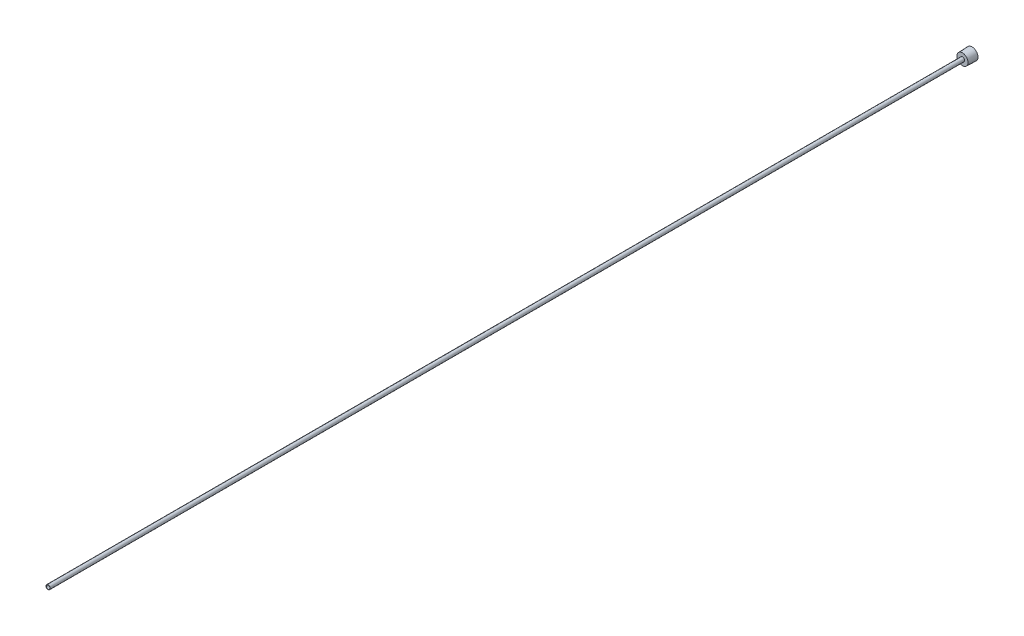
ISO-10303-21;
HEADER;
FILE_DESCRIPTION(('STEP AP214'),'2;1');
FILE_NAME('part.step','',(''),(''),'','','');
FILE_SCHEMA(('AUTOMOTIVE_DESIGN { 1 0 10303 214 1 1 1 1 }'));
ENDSEC;
DATA;
#1=APPLICATION_CONTEXT('core data for automotive mechanical design processes');
#2=APPLICATION_PROTOCOL_DEFINITION('international standard','automotive_design',2000,#1);
#3=PRODUCT_CONTEXT('',#1,'mechanical');
#4=PRODUCT('Part','Part','',(#3));
#5=PRODUCT_RELATED_PRODUCT_CATEGORY('part','',(#4));
#6=PRODUCT_DEFINITION_FORMATION('','',#4);
#7=PRODUCT_DEFINITION_CONTEXT('part definition',#1,'design');
#8=PRODUCT_DEFINITION('design','',#6,#7);
#9=PRODUCT_DEFINITION_SHAPE('','',#8);
#10=(LENGTH_UNIT() NAMED_UNIT(*) SI_UNIT(.MILLI.,.METRE.));
#11=(NAMED_UNIT(*) PLANE_ANGLE_UNIT() SI_UNIT($,.RADIAN.));
#12=(NAMED_UNIT(*) SI_UNIT($,.STERADIAN.) SOLID_ANGLE_UNIT());
#13=UNCERTAINTY_MEASURE_WITH_UNIT(LENGTH_MEASURE(1.E-05),#10,'distance_accuracy_value','');
#14=(GEOMETRIC_REPRESENTATION_CONTEXT(3) GLOBAL_UNCERTAINTY_ASSIGNED_CONTEXT((#13)) GLOBAL_UNIT_ASSIGNED_CONTEXT((#10,
#11,#12)) REPRESENTATION_CONTEXT('',''));
#15=CARTESIAN_POINT('',(0.,0.,0.));
#16=DIRECTION('',(0.,0.,1.));
#17=DIRECTION('',(1.,0.,0.));
#18=AXIS2_PLACEMENT_3D('',#15,#16,#17);
#19=CARTESIAN_POINT('',(0.,0.,0.));
#20=DIRECTION('',(0.,0.,1.));
#21=DIRECTION('',(1.,0.,0.));
#22=AXIS2_PLACEMENT_3D('',#19,#20,#21);
#23=CYLINDRICAL_SURFACE('',#22,1.2065);
#24=CARTESIAN_POINT('',(0.,0.,609.6));
#25=DIRECTION('',(0.,0.,1.));
#26=DIRECTION('',(1.,0.,0.));
#27=AXIS2_PLACEMENT_3D('',#24,#25,#26);
#28=CIRCLE('',#27,1.2065);
#29=CARTESIAN_POINT('',(1.2065,0.,609.6));
#30=VERTEX_POINT('',#29);
#31=EDGE_CURVE('E142',#30,#30,#28,.T.);
#32=CARTESIAN_POINT('',(0.,0.,3.96875));
#33=DIRECTION('',(0.,0.,-1.));
#34=DIRECTION('',(-1.,0.,0.));
#35=AXIS2_PLACEMENT_3D('',#32,#33,#34);
#36=CIRCLE('',#35,1.2065);
#37=CARTESIAN_POINT('',(1.2065,0.,3.96875));
#38=VERTEX_POINT('',#37);
#39=EDGE_CURVE('E37',#38,#38,#36,.F.);
#40=CARTESIAN_POINT('',(1.2065,0.,609.6));
#41=CARTESIAN_POINT('',(1.2065,0.,603.291341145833));
#42=CARTESIAN_POINT('',(1.2065,0.,596.982682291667));
#43=CARTESIAN_POINT('',(1.2065,0.,584.365364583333));
#44=CARTESIAN_POINT('',(1.2065,0.,578.056705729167));
#45=CARTESIAN_POINT('',(1.2065,0.,565.439388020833));
#46=CARTESIAN_POINT('',(1.2065,0.,559.130729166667));
#47=CARTESIAN_POINT('',(1.2065,0.,546.513411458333));
#48=CARTESIAN_POINT('',(1.2065,0.,540.204752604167));
#49=CARTESIAN_POINT('',(1.2065,0.,527.587434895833));
#50=CARTESIAN_POINT('',(1.2065,0.,521.278776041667));
#51=CARTESIAN_POINT('',(1.2065,0.,508.661458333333));
#52=CARTESIAN_POINT('',(1.2065,0.,502.352799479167));
#53=CARTESIAN_POINT('',(1.2065,0.,489.735481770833));
#54=CARTESIAN_POINT('',(1.2065,0.,483.426822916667));
#55=CARTESIAN_POINT('',(1.2065,0.,470.809505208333));
#56=CARTESIAN_POINT('',(1.2065,0.,464.500846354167));
#57=CARTESIAN_POINT('',(1.2065,0.,451.883528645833));
#58=CARTESIAN_POINT('',(1.2065,0.,445.574869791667));
#59=CARTESIAN_POINT('',(1.2065,0.,432.957552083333));
#60=CARTESIAN_POINT('',(1.2065,0.,426.648893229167));
#61=CARTESIAN_POINT('',(1.2065,0.,414.031575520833));
#62=CARTESIAN_POINT('',(1.2065,0.,407.722916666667));
#63=CARTESIAN_POINT('',(1.2065,0.,395.105598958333));
#64=CARTESIAN_POINT('',(1.2065,0.,388.796940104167));
#65=CARTESIAN_POINT('',(1.2065,0.,376.179622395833));
#66=CARTESIAN_POINT('',(1.2065,0.,369.870963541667));
#67=CARTESIAN_POINT('',(1.2065,0.,357.253645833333));
#68=CARTESIAN_POINT('',(1.2065,0.,350.944986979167));
#69=CARTESIAN_POINT('',(1.2065,0.,338.327669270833));
#70=CARTESIAN_POINT('',(1.2065,0.,332.019010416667));
#71=CARTESIAN_POINT('',(1.2065,0.,319.401692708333));
#72=CARTESIAN_POINT('',(1.2065,0.,313.093033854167));
#73=CARTESIAN_POINT('',(1.2065,0.,300.475716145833));
#74=CARTESIAN_POINT('',(1.2065,0.,294.167057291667));
#75=CARTESIAN_POINT('',(1.2065,0.,281.549739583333));
#76=CARTESIAN_POINT('',(1.2065,0.,275.241080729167));
#77=CARTESIAN_POINT('',(1.2065,0.,262.623763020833));
#78=CARTESIAN_POINT('',(1.2065,0.,256.315104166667));
#79=CARTESIAN_POINT('',(1.2065,0.,243.697786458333));
#80=CARTESIAN_POINT('',(1.2065,0.,237.389127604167));
#81=CARTESIAN_POINT('',(1.2065,0.,224.771809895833));
#82=CARTESIAN_POINT('',(1.2065,0.,218.463151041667));
#83=CARTESIAN_POINT('',(1.2065,0.,205.845833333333));
#84=CARTESIAN_POINT('',(1.2065,0.,199.537174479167));
#85=CARTESIAN_POINT('',(1.2065,0.,186.919856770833));
#86=CARTESIAN_POINT('',(1.2065,0.,180.611197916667));
#87=CARTESIAN_POINT('',(1.2065,0.,167.993880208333));
#88=CARTESIAN_POINT('',(1.2065,0.,161.685221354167));
#89=CARTESIAN_POINT('',(1.2065,0.,149.067903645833));
#90=CARTESIAN_POINT('',(1.2065,0.,142.759244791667));
#91=CARTESIAN_POINT('',(1.2065,0.,130.141927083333));
#92=CARTESIAN_POINT('',(1.2065,0.,123.833268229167));
#93=CARTESIAN_POINT('',(1.2065,0.,111.215950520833));
#94=CARTESIAN_POINT('',(1.2065,0.,104.907291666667));
#95=CARTESIAN_POINT('',(1.2065,0.,92.2899739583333));
#96=CARTESIAN_POINT('',(1.2065,0.,85.9813151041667));
#97=CARTESIAN_POINT('',(1.2065,0.,73.3639973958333));
#98=CARTESIAN_POINT('',(1.2065,0.,67.0553385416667));
#99=CARTESIAN_POINT('',(1.2065,0.,54.4380208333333));
#100=CARTESIAN_POINT('',(1.2065,0.,48.1293619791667));
#101=CARTESIAN_POINT('',(1.2065,0.,35.5120442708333));
#102=CARTESIAN_POINT('',(1.2065,0.,29.2033854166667));
#103=CARTESIAN_POINT('',(1.2065,0.,16.5860677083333));
#104=CARTESIAN_POINT('',(1.2065,0.,10.2774088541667));
#105=CARTESIAN_POINT('',(1.2065,0.,3.96874999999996));
#106=B_SPLINE_CURVE_WITH_KNOTS('',3,(#40,#41,#42,#43,#44,#45,#46,#47,#48,#49,#50,#51,#52,#53,
#54,#55,#56,#57,#58,#59,#60,#61,#62,#63,#64,#65,#66,#67,#68,#69,#70,#71,#72,#73,#74,#75,#76,#77,
#78,#79,#80,#81,#82,#83,#84,#85,#86,#87,#88,#89,#90,#91,#92,#93,#94,#95,#96,#97,#98,#99,#100,
#101,#102,#103,#104,#105),.UNSPECIFIED.,.F.,.F.,(4,2,2,2,2,2,2,2,2,2,2,2,2,2,2,2,2,2,2,2,2,2,2,
2,2,2,2,2,2,2,2,2,4),(0.,18.9259765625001,37.851953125,56.7779296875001,75.70390625,
94.6298828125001,113.555859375,132.4818359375,151.4078125,170.3337890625,189.259765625,
208.1857421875,227.11171875,246.0376953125,264.963671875,283.8896484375,302.815625,
321.7416015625,340.667578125,359.5935546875,378.51953125,397.4455078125,416.371484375,
435.2974609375,454.2234375,473.1494140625,492.075390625,511.0013671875,529.92734375,
548.8533203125,567.779296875,586.7052734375,605.63125),.UNSPECIFIED.);
#107=EDGE_CURVE('BSEAM33',#30,#38,#106,.T.);
#108=ORIENTED_EDGE('',*,*,#31,.T.);
#109=ORIENTED_EDGE('',*,*,#39,.F.);
#110=ORIENTED_EDGE('',*,*,#107,.T.);
#111=ORIENTED_EDGE('',*,*,#107,.F.);
#112=EDGE_LOOP('',(#108,#110,#109,#111));
#113=FACE_BOUND('',#112,.T.);
#114=ADVANCED_FACE('F33',(#113),#23,.F.);
#115=CARTESIAN_POINT('',(0.,0.,0.));
#116=DIRECTION('',(0.,0.,1.));
#117=DIRECTION('',(1.,0.,0.));
#118=AXIS2_PLACEMENT_3D('',#115,#116,#117);
#119=PLANE('',#118);
#120=DIRECTION('',(-0.866025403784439,0.5,0.));
#121=VECTOR('',#120,1.);
#122=CARTESIAN_POINT('',(0.,-2.7569630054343,0.));
#123=LINE('',#122,#121);
#124=CARTESIAN_POINT('',(0.,-2.7569630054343,0.));
#125=VERTEX_POINT('',#124);
#126=CARTESIAN_POINT('',(-2.3876,-1.37848150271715,0.));
#127=VERTEX_POINT('',#126);
#128=EDGE_CURVE('E124',#125,#127,#123,.T.);
#129=ORIENTED_EDGE('',*,*,#128,.F.);
#130=DIRECTION('',(-0.866025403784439,-0.5,0.));
#131=VECTOR('',#130,1.);
#132=CARTESIAN_POINT('',(2.3876,-1.37848150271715,0.));
#133=LINE('',#132,#131);
#134=CARTESIAN_POINT('',(2.3876,-1.37848150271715,0.));
#135=VERTEX_POINT('',#134);
#136=EDGE_CURVE('E49',#135,#125,#133,.T.);
#137=ORIENTED_EDGE('',*,*,#136,.F.);
#138=DIRECTION('',(0.,-1.,0.));
#139=VECTOR('',#138,1.);
#140=CARTESIAN_POINT('',(2.3876,1.37848150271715,0.));
#141=LINE('',#140,#139);
#142=CARTESIAN_POINT('',(2.3876,1.37848150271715,0.));
#143=VERTEX_POINT('',#142);
#144=EDGE_CURVE('E133',#143,#135,#141,.T.);
#145=ORIENTED_EDGE('',*,*,#144,.F.);
#146=DIRECTION('',(0.866025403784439,-0.5,0.));
#147=VECTOR('',#146,1.);
#148=CARTESIAN_POINT('',(0.,2.7569630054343,0.));
#149=LINE('',#148,#147);
#150=CARTESIAN_POINT('',(0.,2.7569630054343,0.));
#151=VERTEX_POINT('',#150);
#152=EDGE_CURVE('E131',#151,#143,#149,.T.);
#153=ORIENTED_EDGE('',*,*,#152,.F.);
#154=DIRECTION('',(0.866025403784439,0.5,0.));
#155=VECTOR('',#154,1.);
#156=CARTESIAN_POINT('',(-2.3876,1.37848150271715,0.));
#157=LINE('',#156,#155);
#158=CARTESIAN_POINT('',(-2.3876,1.37848150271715,0.));
#159=VERTEX_POINT('',#158);
#160=EDGE_CURVE('E97',#159,#151,#157,.T.);
#161=ORIENTED_EDGE('',*,*,#160,.F.);
#162=DIRECTION('',(0.,1.,0.));
#163=VECTOR('',#162,1.);
#164=CARTESIAN_POINT('',(-2.3876,-1.37848150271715,0.));
#165=LINE('',#164,#163);
#166=EDGE_CURVE('E127',#127,#159,#165,.T.);
#167=ORIENTED_EDGE('',*,*,#166,.F.);
#168=EDGE_LOOP('',(#129,#137,#145,#153,#161,#167));
#169=FACE_BOUND('',#168,.T.);
#170=CARTESIAN_POINT('',(0.,0.,0.));
#171=DIRECTION('',(0.,0.,1.));
#172=DIRECTION('',(1.,0.,0.));
#173=AXIS2_PLACEMENT_3D('',#170,#171,#172);
#174=CIRCLE('',#173,3.8989);
#175=CARTESIAN_POINT('',(3.8989,0.,0.));
#176=VERTEX_POINT('',#175);
#177=EDGE_CURVE('E11',#176,#176,#174,.T.);
#178=ORIENTED_EDGE('',*,*,#177,.F.);
#179=EDGE_LOOP('',(#178));
#180=FACE_BOUND('',#179,.T.);
#181=ADVANCED_FACE('F35',(#169,#180),#119,.F.);
#182=CARTESIAN_POINT('',(0.,0.,0.));
#183=DIRECTION('',(0.,0.,-1.));
#184=DIRECTION('',(-1.,0.,0.));
#185=AXIS2_PLACEMENT_3D('',#182,#183,#184);
#186=CONICAL_SURFACE('',#185,3.8989,0.0364424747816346);
#187=CARTESIAN_POINT('',(0.,0.,6.35));
#188=DIRECTION('',(0.,0.,1.));
#189=DIRECTION('',(1.,0.,0.));
#190=AXIS2_PLACEMENT_3D('',#187,#188,#189);
#191=CIRCLE('',#190,3.66738778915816);
#192=CARTESIAN_POINT('',(3.66738778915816,0.,6.35));
#193=VERTEX_POINT('',#192);
#194=EDGE_CURVE('E42',#193,#193,#191,.T.);
#195=ORIENTED_EDGE('',*,*,#194,.F.);
#196=EDGE_LOOP('',(#195));
#197=FACE_BOUND('',#196,.T.);
#198=ORIENTED_EDGE('',*,*,#177,.T.);
#199=EDGE_LOOP('',(#198));
#200=FACE_BOUND('',#199,.T.);
#201=ADVANCED_FACE('F156',(#197,#200),#186,.T.);
#202=CARTESIAN_POINT('',(0.,3.66738778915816,6.35));
#203=DIRECTION('',(0.,0.,-1.));
#204=DIRECTION('',(-1.,0.,0.));
#205=AXIS2_PLACEMENT_3D('',#202,#203,#204);
#206=PLANE('',#205);
#207=CARTESIAN_POINT('',(0.,0.,6.35));
#208=DIRECTION('',(0.,0.,1.));
#209=DIRECTION('',(1.,0.,0.));
#210=AXIS2_PLACEMENT_3D('',#207,#208,#209);
#211=CIRCLE('',#210,1.3890625);
#212=CARTESIAN_POINT('',(1.3890625,0.,6.35));
#213=VERTEX_POINT('',#212);
#214=EDGE_CURVE('E148',#213,#213,#211,.T.);
#215=ORIENTED_EDGE('',*,*,#214,.F.);
#216=EDGE_LOOP('',(#215));
#217=FACE_BOUND('',#216,.T.);
#218=ORIENTED_EDGE('',*,*,#194,.T.);
#219=EDGE_LOOP('',(#218));
#220=FACE_BOUND('',#219,.T.);
#221=ADVANCED_FACE('F154',(#217,#220),#206,.F.);
#222=CARTESIAN_POINT('',(0.,0.,0.));
#223=DIRECTION('',(0.,0.,1.));
#224=DIRECTION('',(1.,0.,0.));
#225=AXIS2_PLACEMENT_3D('',#222,#223,#224);
#226=CYLINDRICAL_SURFACE('',#225,1.38906249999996);
#227=CARTESIAN_POINT('',(0.,0.,609.6));
#228=DIRECTION('',(0.,0.,1.));
#229=DIRECTION('',(1.,0.,0.));
#230=AXIS2_PLACEMENT_3D('',#227,#228,#229);
#231=CIRCLE('',#230,1.38906249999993);
#232=CARTESIAN_POINT('',(1.38906249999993,0.,609.6));
#233=VERTEX_POINT('',#232);
#234=EDGE_CURVE('E145',#233,#233,#231,.T.);
#235=ORIENTED_EDGE('',*,*,#234,.F.);
#236=EDGE_LOOP('',(#235));
#237=FACE_BOUND('',#236,.T.);
#238=ORIENTED_EDGE('',*,*,#214,.T.);
#239=EDGE_LOOP('',(#238));
#240=FACE_BOUND('',#239,.T.);
#241=ADVANCED_FACE('F190',(#237,#240),#226,.T.);
#242=CARTESIAN_POINT('',(0.,1.38906249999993,609.6));
#243=DIRECTION('',(0.,0.,-1.));
#244=DIRECTION('',(-1.,0.,0.));
#245=AXIS2_PLACEMENT_3D('',#242,#243,#244);
#246=PLANE('',#245);
#247=ORIENTED_EDGE('',*,*,#31,.F.);
#248=EDGE_LOOP('',(#247));
#249=FACE_BOUND('',#248,.T.);
#250=ORIENTED_EDGE('',*,*,#234,.T.);
#251=EDGE_LOOP('',(#250));
#252=FACE_BOUND('',#251,.T.);
#253=ADVANCED_FACE('F183',(#249,#252),#246,.F.);
#254=CARTESIAN_POINT('',(0.,-2.7569630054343,3.96875));
#255=DIRECTION('',(0.,0.,-1.));
#256=DIRECTION('',(-1.,0.,0.));
#257=AXIS2_PLACEMENT_3D('',#254,#255,#256);
#258=PLANE('',#257);
#259=DIRECTION('',(-0.866025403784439,-0.5,0.));
#260=VECTOR('',#259,1.);
#261=CARTESIAN_POINT('',(2.3876,-1.37848150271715,3.96875));
#262=LINE('',#261,#260);
#263=CARTESIAN_POINT('',(2.3876,-1.37848150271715,3.96875));
#264=VERTEX_POINT('',#263);
#265=CARTESIAN_POINT('',(0.,-2.7569630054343,3.96875));
#266=VERTEX_POINT('',#265);
#267=EDGE_CURVE('E135',#264,#266,#262,.T.);
#268=ORIENTED_EDGE('',*,*,#267,.T.);
#269=DIRECTION('',(-0.866025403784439,0.5,0.));
#270=VECTOR('',#269,1.);
#271=CARTESIAN_POINT('',(0.,-2.7569630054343,3.96875));
#272=LINE('',#271,#270);
#273=CARTESIAN_POINT('',(-2.3876,-1.37848150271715,3.96875));
#274=VERTEX_POINT('',#273);
#275=EDGE_CURVE('E118',#266,#274,#272,.T.);
#276=ORIENTED_EDGE('',*,*,#275,.T.);
#277=DIRECTION('',(0.,1.,0.));
#278=VECTOR('',#277,1.);
#279=CARTESIAN_POINT('',(-2.3876,-1.37848150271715,3.96875));
#280=LINE('',#279,#278);
#281=CARTESIAN_POINT('',(-2.3876,1.37848150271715,3.96875));
#282=VERTEX_POINT('',#281);
#283=EDGE_CURVE('E116',#274,#282,#280,.T.);
#284=ORIENTED_EDGE('',*,*,#283,.T.);
#285=DIRECTION('',(0.866025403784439,0.5,0.));
#286=VECTOR('',#285,1.);
#287=CARTESIAN_POINT('',(-2.3876,1.37848150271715,3.96875));
#288=LINE('',#287,#286);
#289=CARTESIAN_POINT('',(0.,2.7569630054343,3.96875));
#290=VERTEX_POINT('',#289);
#291=EDGE_CURVE('E94',#282,#290,#288,.T.);
#292=ORIENTED_EDGE('',*,*,#291,.T.);
#293=DIRECTION('',(0.866025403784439,-0.5,0.));
#294=VECTOR('',#293,1.);
#295=CARTESIAN_POINT('',(0.,2.7569630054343,3.96875));
#296=LINE('',#295,#294);
#297=CARTESIAN_POINT('',(2.3876,1.37848150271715,3.96875));
#298=VERTEX_POINT('',#297);
#299=EDGE_CURVE('E105',#290,#298,#296,.T.);
#300=ORIENTED_EDGE('',*,*,#299,.T.);
#301=DIRECTION('',(0.,-1.,0.));
#302=VECTOR('',#301,1.);
#303=CARTESIAN_POINT('',(2.3876,1.37848150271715,3.96875));
#304=LINE('',#303,#302);
#305=EDGE_CURVE('E109',#298,#264,#304,.T.);
#306=ORIENTED_EDGE('',*,*,#305,.T.);
#307=EDGE_LOOP('',(#268,#276,#284,#292,#300,#306));
#308=FACE_BOUND('',#307,.T.);
#309=ORIENTED_EDGE('',*,*,#39,.T.);
#310=EDGE_LOOP('',(#309));
#311=FACE_BOUND('',#310,.T.);
#312=ADVANCED_FACE('F112',(#308,#311),#258,.T.);
#313=CARTESIAN_POINT('',(2.3876,-1.37848150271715,3.96875));
#314=DIRECTION('',(0.5,-0.866025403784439,0.));
#315=DIRECTION('',(0.866025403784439,0.5,0.));
#316=AXIS2_PLACEMENT_3D('',#313,#314,#315);
#317=PLANE('',#316);
#318=ORIENTED_EDGE('',*,*,#136,.T.);
#319=DIRECTION('',(0.,0.,-1.));
#320=VECTOR('',#319,1.);
#321=CARTESIAN_POINT('',(0.,-2.7569630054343,3.96875));
#322=LINE('',#321,#320);
#323=EDGE_CURVE('E79',#266,#125,#322,.T.);
#324=ORIENTED_EDGE('',*,*,#323,.F.);
#325=ORIENTED_EDGE('',*,*,#267,.F.);
#326=DIRECTION('',(0.,0.,-1.));
#327=VECTOR('',#326,1.);
#328=CARTESIAN_POINT('',(2.3876,-1.37848150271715,3.96875));
#329=LINE('',#328,#327);
#330=EDGE_CURVE('E57',#264,#135,#329,.T.);
#331=ORIENTED_EDGE('',*,*,#330,.T.);
#332=EDGE_LOOP('',(#318,#324,#325,#331));
#333=FACE_BOUND('',#332,.T.);
#334=ADVANCED_FACE('F174',(#333),#317,.F.);
#335=CARTESIAN_POINT('',(2.3876,1.37848150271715,3.96875));
#336=DIRECTION('',(1.,0.,0.));
#337=DIRECTION('',(0.,0.,-1.));
#338=AXIS2_PLACEMENT_3D('',#335,#336,#337);
#339=PLANE('',#338);
#340=ORIENTED_EDGE('',*,*,#144,.T.);
#341=ORIENTED_EDGE('',*,*,#330,.F.);
#342=ORIENTED_EDGE('',*,*,#305,.F.);
#343=DIRECTION('',(0.,0.,-1.));
#344=VECTOR('',#343,1.);
#345=CARTESIAN_POINT('',(2.3876,1.37848150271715,3.96875));
#346=LINE('',#345,#344);
#347=EDGE_CURVE('E101',#298,#143,#346,.T.);
#348=ORIENTED_EDGE('',*,*,#347,.T.);
#349=EDGE_LOOP('',(#340,#341,#342,#348));
#350=FACE_BOUND('',#349,.T.);
#351=ADVANCED_FACE('F176',(#350),#339,.F.);
#352=CARTESIAN_POINT('',(0.,2.7569630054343,3.96875));
#353=DIRECTION('',(0.5,0.866025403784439,0.));
#354=DIRECTION('',(-0.866025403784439,0.5,0.));
#355=AXIS2_PLACEMENT_3D('',#352,#353,#354);
#356=PLANE('',#355);
#357=ORIENTED_EDGE('',*,*,#152,.T.);
#358=ORIENTED_EDGE('',*,*,#347,.F.);
#359=ORIENTED_EDGE('',*,*,#299,.F.);
#360=DIRECTION('',(0.,0.,-1.));
#361=VECTOR('',#360,1.);
#362=CARTESIAN_POINT('',(0.,2.7569630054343,3.96875));
#363=LINE('',#362,#361);
#364=EDGE_CURVE('E90',#290,#151,#363,.T.);
#365=ORIENTED_EDGE('',*,*,#364,.T.);
#366=EDGE_LOOP('',(#357,#358,#359,#365));
#367=FACE_BOUND('',#366,.T.);
#368=ADVANCED_FACE('F106',(#367),#356,.F.);
#369=CARTESIAN_POINT('',(-2.3876,1.37848150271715,3.96875));
#370=DIRECTION('',(-0.5,0.866025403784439,0.));
#371=DIRECTION('',(-0.866025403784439,-0.5,0.));
#372=AXIS2_PLACEMENT_3D('',#369,#370,#371);
#373=PLANE('',#372);
#374=ORIENTED_EDGE('',*,*,#160,.T.);
#375=ORIENTED_EDGE('',*,*,#364,.F.);
#376=ORIENTED_EDGE('',*,*,#291,.F.);
#377=DIRECTION('',(0.,0.,-1.));
#378=VECTOR('',#377,1.);
#379=CARTESIAN_POINT('',(-2.3876,1.37848150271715,3.96875));
#380=LINE('',#379,#378);
#381=EDGE_CURVE('E102',#282,#159,#380,.T.);
#382=ORIENTED_EDGE('',*,*,#381,.T.);
#383=EDGE_LOOP('',(#374,#375,#376,#382));
#384=FACE_BOUND('',#383,.T.);
#385=ADVANCED_FACE('F92',(#384),#373,.F.);
#386=CARTESIAN_POINT('',(-2.3876,-1.37848150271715,3.96875));
#387=DIRECTION('',(-1.,0.,0.));
#388=DIRECTION('',(0.,-1.,0.));
#389=AXIS2_PLACEMENT_3D('',#386,#387,#388);
#390=PLANE('',#389);
#391=ORIENTED_EDGE('',*,*,#166,.T.);
#392=ORIENTED_EDGE('',*,*,#381,.F.);
#393=ORIENTED_EDGE('',*,*,#283,.F.);
#394=DIRECTION('',(0.,0.,-1.));
#395=VECTOR('',#394,1.);
#396=CARTESIAN_POINT('',(-2.3876,-1.37848150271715,3.96875));
#397=LINE('',#396,#395);
#398=EDGE_CURVE('E139',#274,#127,#397,.T.);
#399=ORIENTED_EDGE('',*,*,#398,.T.);
#400=EDGE_LOOP('',(#391,#392,#393,#399));
#401=FACE_BOUND('',#400,.T.);
#402=ADVANCED_FACE('F246',(#401),#390,.F.);
#403=CARTESIAN_POINT('',(0.,-2.7569630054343,3.96875));
#404=DIRECTION('',(-0.5,-0.866025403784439,0.));
#405=DIRECTION('',(0.866025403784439,-0.5,0.));
#406=AXIS2_PLACEMENT_3D('',#403,#404,#405);
#407=PLANE('',#406);
#408=ORIENTED_EDGE('',*,*,#128,.T.);
#409=ORIENTED_EDGE('',*,*,#398,.F.);
#410=ORIENTED_EDGE('',*,*,#275,.F.);
#411=ORIENTED_EDGE('',*,*,#323,.T.);
#412=EDGE_LOOP('',(#408,#409,#410,#411));
#413=FACE_BOUND('',#412,.T.);
#414=ADVANCED_FACE('F172',(#413),#407,.F.);
#415=CLOSED_SHELL('',(#114,#181,#201,#221,#241,#253,#312,#334,#351,#368,#385,#402,#414));
#416=MANIFOLD_SOLID_BREP('B2',#415);
#417=ADVANCED_BREP_SHAPE_REPRESENTATION('',(#18,#416),#14);
#418=SHAPE_DEFINITION_REPRESENTATION(#9,#417);
ENDSEC;
END-ISO-10303-21;
